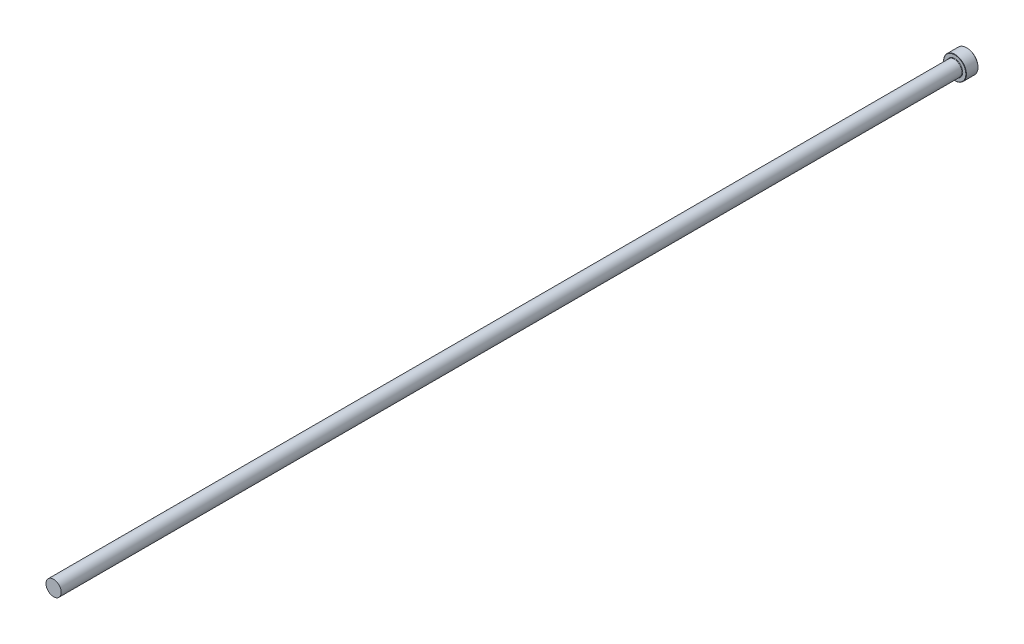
from build123d import *

# Parameters (mm, degrees)
CHAMFER1_SIZE = 0.2


with BuildPart() as part:
    # Sketch1 → Revolve1 (revolve)
    with BuildSketch(Plane(origin=(0, 0, 0), x_dir=(0, 0, -1), z_dir=(1, 0, 0)), mode=Mode.PRIVATE) as revolve1_sk:
        with BuildLine():
            Line((0, 0), (0, 7.5))
            Line((0, 7.5), (-8, 7.5))
            Line((-8, 7.5), (-8, 5.3))
            ThreePointArc((-8, 5.3), (-8.087867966, 5.087867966), (-8.3, 5))
            Line((-8.3, 5), (-600, 5))
            Line((-600, 5), (-600, 0))
            Line((-600, 0), (0, 0))
        make_face()
    revolve(revolve1_sk.sketch.rotate(Axis((0, 0, 109.05062828), (0, 0, -1)), 90), axis=Axis((0, 0, 109.05062828), (0, 0, -1)))

    # Chamfer1
    chamfer1_edges = [part.edges().sort_by_distance(p)[0] for p in [
        (-7.5, 0, 0),
        (-7.5, 0, 8),
    ]]
    chamfer(chamfer1_edges, length=CHAMFER1_SIZE)


solid = part.part
